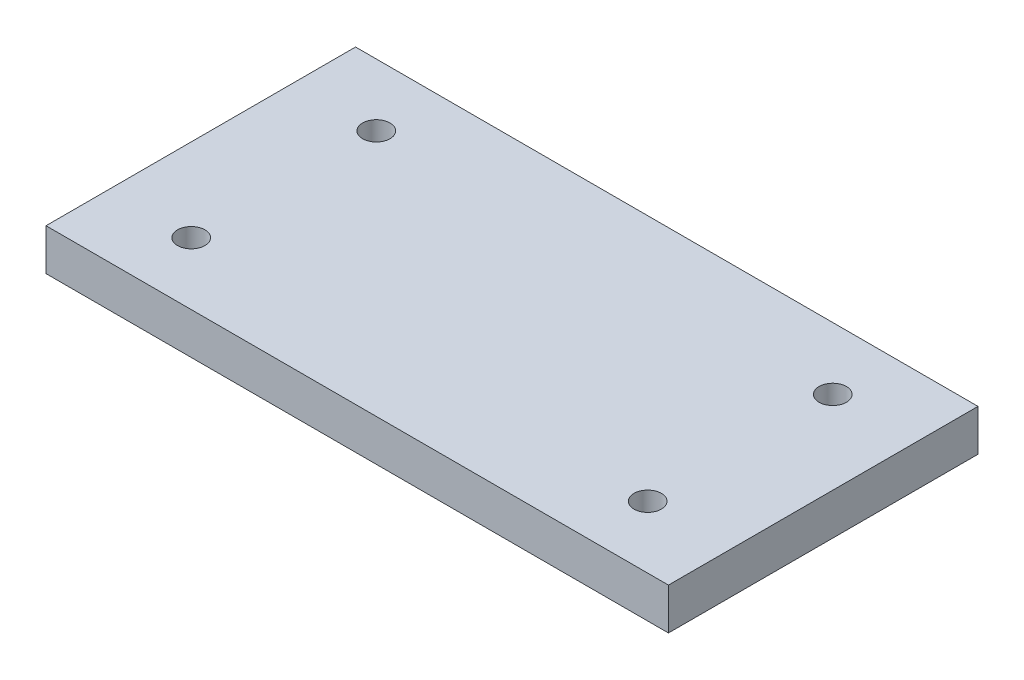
from build123d import *

# Parameters (mm, degrees)
CROQUIS1_W              = 75
CROQUIS1_H              = 37.3
CROQUIS1_R              = 1.65
SALIENTE_EXTRUIR1_DEPTH = 5


with BuildPart() as part:
    # Croquis1 → Saliente-Extruir1 (new body)
    with BuildSketch(Plane(origin=(0, 0, 0), x_dir=(1, 0, 0), z_dir=(0, 1, 0))):
        with Locations((-37.5, -18.65)):
            Rectangle(CROQUIS1_W, CROQUIS1_H)
        with Locations(Location((-65, -7.5, 0), (0, 0, 270))):
            Circle(CROQUIS1_R, mode=Mode.SUBTRACT)
        with Locations(Location((-65, -29.8, 0), (0, 0, 270))):
            Circle(CROQUIS1_R, mode=Mode.SUBTRACT)
        with Locations(Location((-10, -7.5, 0), (0, 0, 270))):
            Circle(CROQUIS1_R, mode=Mode.SUBTRACT)
        with Locations(Location((-10, -29.8, 0), (0, 0, 270))):
            Circle(CROQUIS1_R, mode=Mode.SUBTRACT)
    extrude(amount=SALIENTE_EXTRUIR1_DEPTH)


solid = part.part
